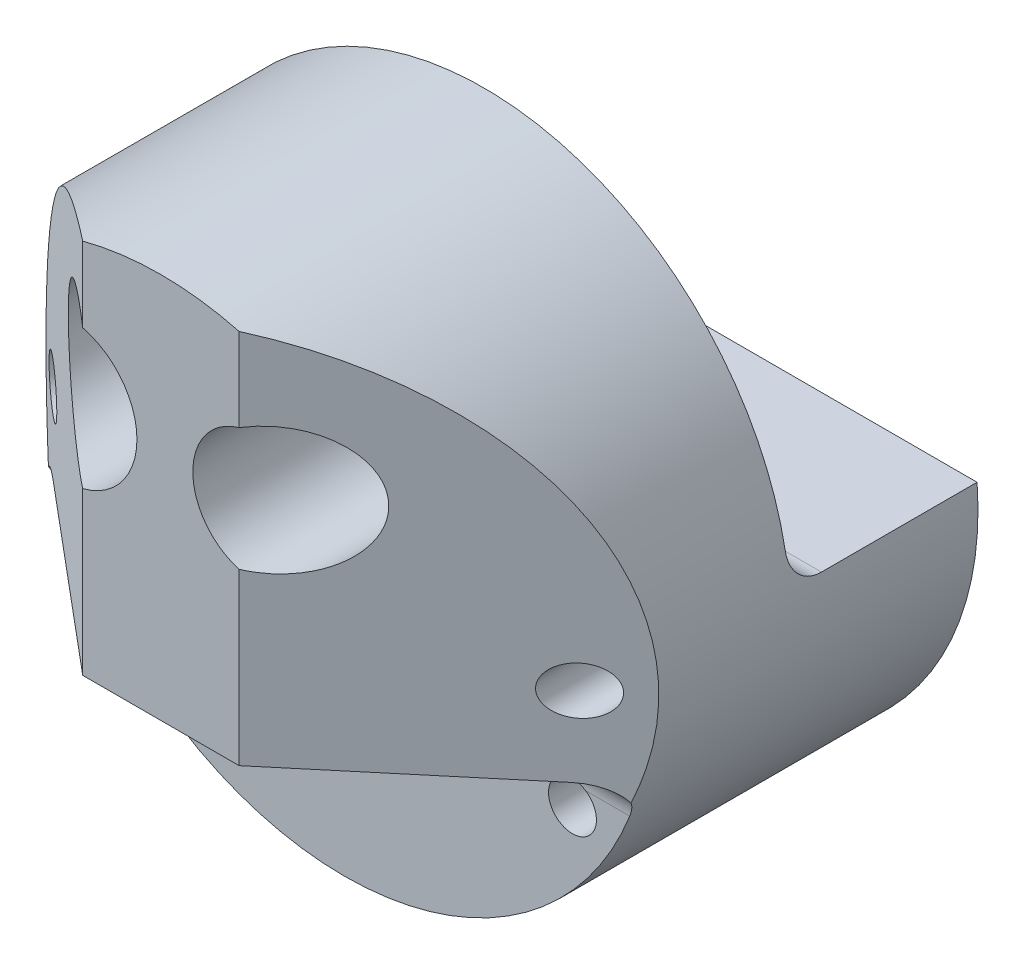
from build123d import *

# Parameters (mm, degrees)
SKETCH1_R                = 60.96
BOSS_EXTRUDE1_DEPTH      = 101.6
CUT_EXTRUDE1_DEPTH       = 134.247150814
CUT_EXTRUDE1_DEPTH_BACK  = 134.247150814
F_1_1_DIAMETER_HOLE1_D   = 25.4
F_1_1_8_DIAMETER_HOLE3_D = 28.575
CUT_EXTRUDE2_DEPTH       = 134.247150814
CUT_EXTRUDE2_DEPTH_BACK  = 134.247150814
CUT_EXTRUDE3_DEPTH       = 40.48125
CUT_EXTRUDE4_DEPTH       = 134.247150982
CUT_EXTRUDE4_DEPTH_BACK  = 134.247150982
FILLET2_R                = 6.35
CUT_EXTRUDE5_START       = -57.15
SKETCH9_R                = 4.7625
CUT_EXTRUDE5_DEPTH       = 77.097150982
F_10_CLEARANCE_HOLE1_D   = 5.1054


with BuildPart() as part:
    # Sketch1 → Boss-Extrude1 (new body)
    with BuildSketch(Plane.XY):
        Circle(SKETCH1_R)
    extrude(amount=BOSS_EXTRUDE1_DEPTH)

    # Sketch3 → Cut-Extrude1 (cut, two sides: drawn at the far end of the back side and taken through both)
    with BuildSketch(Plane(origin=(0, 0, 0), x_dir=(1, 0, 0), z_dir=(0, 1, 0)).offset(-CUT_EXTRUDE1_DEPTH_BACK)):
        Polygon((60.96, -63.5), (60.96, -101.6), (15.554188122, -101.6), align=None)
        Polygon((-60.96, -63.5), (-15.554188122, -101.6), (-60.96, -101.6), align=None)
    extrude(amount=CUT_EXTRUDE1_DEPTH + CUT_EXTRUDE1_DEPTH_BACK, mode=Mode.SUBTRACT)

    # 1 _1_ Diameter Hole1 (through all)
    with Locations(Plane(origin=(0, 0, 0), x_dir=(-1, 0, 0), z_dir=(0, 0, -1))):
        with Locations((-19.05, 30.1625)):
            Hole(F_1_1_DIAMETER_HOLE1_D / 2)

    # 1 1_8 Diameter Hole3 (through all)
    with Locations(Plane(origin=(0, 0, 0), x_dir=(-1, 0, 0), z_dir=(0, 0, -1))):
        with Locations((19.05, 30.1625)):
            Hole(F_1_1_8_DIAMETER_HOLE3_D / 2)

    # Sketch4 → Cut-Extrude2 (cut, two sides: drawn at the far end of the back side and taken through both)
    with BuildSketch(Plane(origin=(0, 0, 0), x_dir=(0, 0, -1), z_dir=(1, 0, 0)).offset(-CUT_EXTRUDE2_DEPTH_BACK)):
        with BuildLine():
            Line((-37.30625, 60.96), (0, 60.96))
            Line((0, 60.96), (0, 4.7625))
            Line((0, 4.7625), (-30.95625, 4.7625))
            ThreePointArc((-30.95625, 4.7625), (-35.446378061, 6.622371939), (-37.30625, 11.1125))
            Line((-37.30625, 11.1125), (-37.30625, 60.96))
        make_face()
    extrude(amount=CUT_EXTRUDE2_DEPTH + CUT_EXTRUDE2_DEPTH_BACK, mode=Mode.SUBTRACT)

    # Sketch7 → Cut-Extrude3 (cut, symmetric)
    with BuildSketch(Plane(origin=(0, 0, 0), x_dir=(0, 0, -1), z_dir=(1, 0, 0))):
        with BuildLine():
            Line((0, -31.75), (-33.3375, -31.75))
            ThreePointArc((-33.3375, -31.75), (-37.827628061, -33.609871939), (-39.6875, -38.1))
            Line((-39.6875, -38.1), (-39.6875, -60.96))
            Line((-39.6875, -60.96), (0, -60.96))
            Line((0, -60.96), (0, -31.75))
        make_face()
    extrude(amount=CUT_EXTRUDE3_DEPTH, both=True, mode=Mode.SUBTRACT)

    # Sketch8 → Cut-Extrude4 (cut, two sides: drawn at the far end of the back side and taken through both)
    with BuildSketch(Plane(origin=(0, 0, 0), x_dir=(0, 0, -1), z_dir=(1, 0, 0)).offset(-CUT_EXTRUDE4_DEPTH_BACK)):
        with BuildLine():
            Line((-65.0875, -60.96), (-101.6, -60.96))
            Line((-101.6, -60.96), (-101.6, -15.875))
            Line((-101.6, -15.875), (-71.4375, -15.875))
            ThreePointArc((-71.4375, -15.875), (-66.947371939, -17.734871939), (-65.0875, -22.225))
            Line((-65.0875, -22.225), (-65.0875, -60.96))
        make_face()
    extrude(amount=CUT_EXTRUDE4_DEPTH + CUT_EXTRUDE4_DEPTH_BACK, mode=Mode.SUBTRACT)

    # Fillet2
    fillet2_edges = [part.edges().sort_by_distance(p)[0] for p in [
        (-40.48125, -41.839196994, 39.6875),
        (40.48125, -41.839196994, 39.6875),
        (40.48125, -31.75, 16.66875),
        (40.48125, -33.609871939, 37.827628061),
        (-40.48125, -33.609871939, 37.827628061),
        (-40.48125, -31.75, 16.66875),
    ]]
    fillet(fillet2_edges, radius=FILLET2_R)

    # Sketch9 → Cut-Extrude5 (cut, through all)
    with BuildSketch(Plane(origin=(0, 0, 0), x_dir=(-1, 0, 0), z_dir=(0, 0, -1)).offset(CUT_EXTRUDE5_START)):
        with Locations((-52.3875, 0)):
            Circle(SKETCH9_R)
        with Locations((52.3875, 0)):
            Circle(SKETCH9_R)
        with Locations((45.368905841, -26.19375)):
            Circle(SKETCH9_R)
        with Locations((-45.368905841, -26.19375)):
            Circle(SKETCH9_R)
    extrude(amount=-CUT_EXTRUDE5_DEPTH, mode=Mode.SUBTRACT)

    # 10 Clearance Hole1 (through all)
    with Locations(Plane(origin=(0, 0, 0), x_dir=(-1, 0, 0), z_dir=(0, 0, -1))):
        with Locations((-52.3875, 0), (-45.368905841, -26.19375), (45.368905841, -26.19375), (52.3875, 0)):
            Hole(F_10_CLEARANCE_HOLE1_D / 2)


solid = part.part
